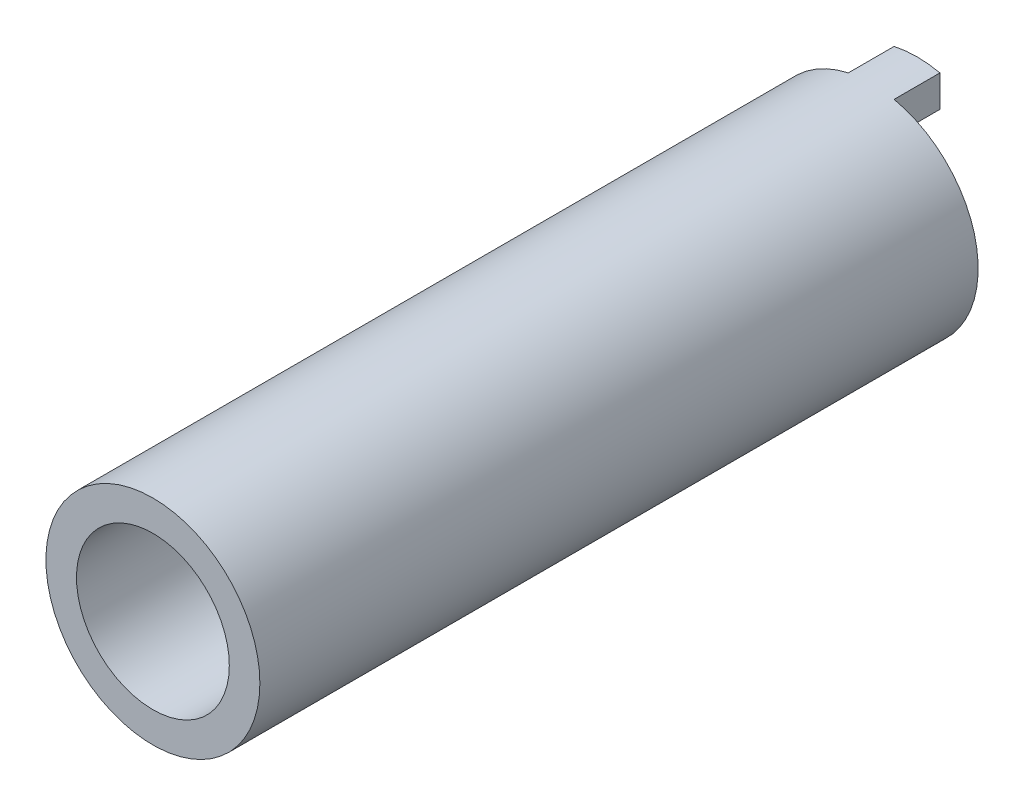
from build123d import *

# Parameters (mm, degrees)
SKETCH_1_R               = 7
SKETCH_1_R_2             = 5
EXTRUDE_1_DEPTH          = 50
CUT_EXTRUDE_1_DEPTH      = 50
CUT_EXTRUDE_1_DEPTH_BACK = 50
SKETCH_2_W               = 6.297094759
SKETCH_2_H               = 5.673142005


with BuildPart() as part:
    # Sketch 1 → Extrude 1 (new body)
    with BuildSketch(Plane.XY):
        Circle(SKETCH_1_R)
        Circle(SKETCH_1_R_2, mode=Mode.SUBTRACT)
    extrude(amount=EXTRUDE_1_DEPTH)

    # Sketch 2 → Cut-Extrude 1 (cut, two sides: drawn at the far end of the back side and taken through both)
    with BuildSketch(Plane(origin=(0, 0, 0), x_dir=(1, 0, 0), z_dir=(0, 1, 0)).offset(-CUT_EXTRUDE_1_DEPTH_BACK)):
        with Locations((4.64854738, -0.163428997)):
            Rectangle(SKETCH_2_W, SKETCH_2_H)
        with Locations((-4.64854738, -0.163428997)):
            Rectangle(SKETCH_2_W, SKETCH_2_H)
    extrude(amount=CUT_EXTRUDE_1_DEPTH + CUT_EXTRUDE_1_DEPTH_BACK, mode=Mode.SUBTRACT)


solid = part.part
